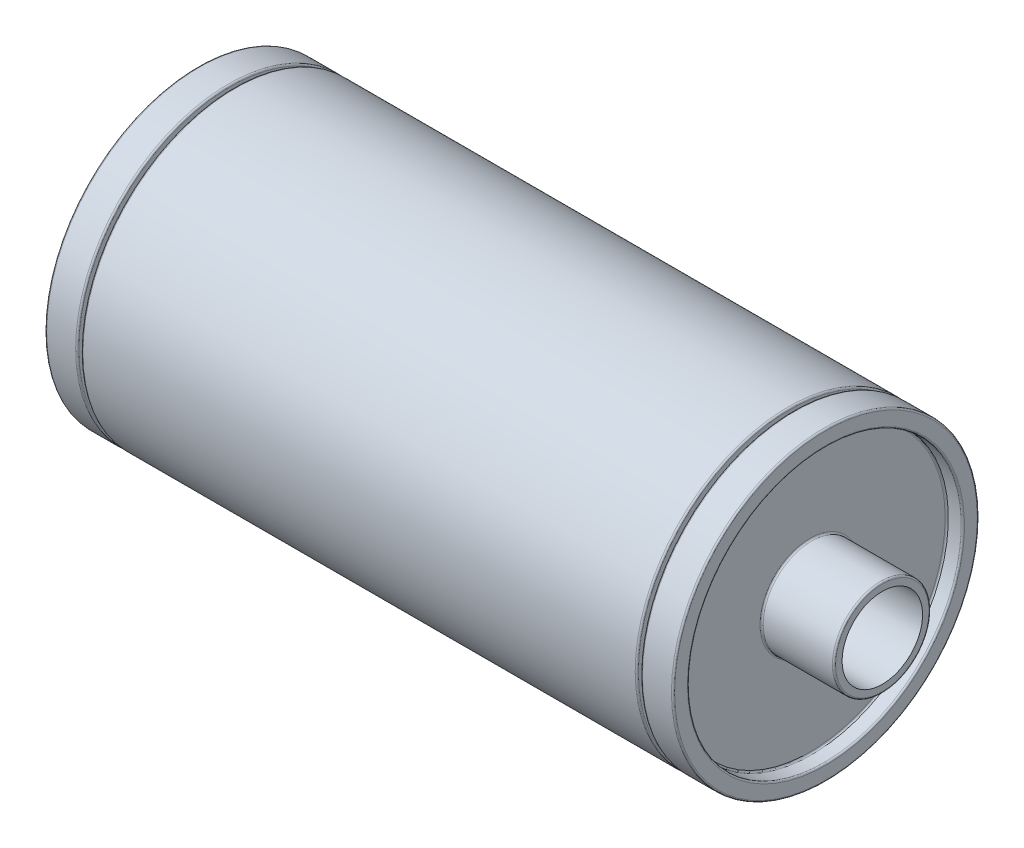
ISO-10303-21;
HEADER;
FILE_DESCRIPTION(('STEP AP214'),'2;1');
FILE_NAME('part.step','',(''),(''),'','','');
FILE_SCHEMA(('AUTOMOTIVE_DESIGN { 1 0 10303 214 1 1 1 1 }'));
ENDSEC;
DATA;
#1=APPLICATION_CONTEXT('core data for automotive mechanical design processes');
#2=APPLICATION_PROTOCOL_DEFINITION('international standard','automotive_design',2000,#1);
#3=PRODUCT_CONTEXT('',#1,'mechanical');
#4=PRODUCT('Part','Part','',(#3));
#5=PRODUCT_RELATED_PRODUCT_CATEGORY('part','',(#4));
#6=PRODUCT_DEFINITION_FORMATION('','',#4);
#7=PRODUCT_DEFINITION_CONTEXT('part definition',#1,'design');
#8=PRODUCT_DEFINITION('design','',#6,#7);
#9=PRODUCT_DEFINITION_SHAPE('','',#8);
#10=(LENGTH_UNIT() NAMED_UNIT(*) SI_UNIT(.MILLI.,.METRE.));
#11=(NAMED_UNIT(*) PLANE_ANGLE_UNIT() SI_UNIT($,.RADIAN.));
#12=(NAMED_UNIT(*) SI_UNIT($,.STERADIAN.) SOLID_ANGLE_UNIT());
#13=UNCERTAINTY_MEASURE_WITH_UNIT(LENGTH_MEASURE(1.E-05),#10,'distance_accuracy_value','');
#14=(GEOMETRIC_REPRESENTATION_CONTEXT(3) GLOBAL_UNCERTAINTY_ASSIGNED_CONTEXT((#13)) GLOBAL_UNIT_ASSIGNED_CONTEXT((#10,
#11,#12)) REPRESENTATION_CONTEXT('',''));
#15=CARTESIAN_POINT('',(0.,0.,0.));
#16=DIRECTION('',(0.,0.,1.));
#17=DIRECTION('',(1.,0.,0.));
#18=AXIS2_PLACEMENT_3D('',#15,#16,#17);
#19=CARTESIAN_POINT('',(-23.,2.5,0.));
#20=DIRECTION('',(1.,0.,0.));
#21=DIRECTION('',(0.,0.,-1.));
#22=AXIS2_PLACEMENT_3D('',#19,#20,#21);
#23=PLANE('',#22);
#24=CARTESIAN_POINT('',(-23.,0.,0.));
#25=DIRECTION('',(1.,0.,0.));
#26=DIRECTION('',(0.,0.,-1.));
#27=AXIS2_PLACEMENT_3D('',#24,#25,#26);
#28=CIRCLE('',#27,2.9);
#29=CARTESIAN_POINT('',(-23.,0.,-2.9));
#30=VERTEX_POINT('',#29);
#31=EDGE_CURVE('E97',#30,#30,#28,.F.);
#32=ORIENTED_EDGE('',*,*,#31,.T.);
#33=EDGE_LOOP('',(#32));
#34=FACE_BOUND('',#33,.T.);
#35=CARTESIAN_POINT('',(-23.,0.,0.));
#36=DIRECTION('',(-1.,0.,0.));
#37=DIRECTION('',(0.,0.,1.));
#38=AXIS2_PLACEMENT_3D('',#35,#36,#37);
#39=CIRCLE('',#38,2.5);
#40=CARTESIAN_POINT('',(-23.,0.,2.5));
#41=VERTEX_POINT('',#40);
#42=EDGE_CURVE('E136',#41,#41,#39,.T.);
#43=ORIENTED_EDGE('',*,*,#42,.F.);
#44=EDGE_LOOP('',(#43));
#45=FACE_BOUND('',#44,.T.);
#46=ADVANCED_FACE('F30',(#34,#45),#23,.F.);
#47=CARTESIAN_POINT('',(-72.4264344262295,0.,0.));
#48=DIRECTION('',(-1.,0.,0.));
#49=DIRECTION('',(0.,0.,1.));
#50=AXIS2_PLACEMENT_3D('',#47,#48,#49);
#51=CYLINDRICAL_SURFACE('',#50,3.);
#52=CARTESIAN_POINT('',(-22.9,0.,0.));
#53=DIRECTION('',(1.,0.,0.));
#54=DIRECTION('',(0.,0.,-1.));
#55=AXIS2_PLACEMENT_3D('',#52,#53,#54);
#56=CIRCLE('',#55,3.);
#57=CARTESIAN_POINT('',(-22.9,0.,-3.));
#58=VERTEX_POINT('',#57);
#59=EDGE_CURVE('E91',#58,#58,#56,.T.);
#60=ORIENTED_EDGE('',*,*,#59,.T.);
#61=EDGE_LOOP('',(#60));
#62=FACE_BOUND('',#61,.T.);
#63=CARTESIAN_POINT('',(-18.6,0.,0.));
#64=DIRECTION('',(1.,0.,0.));
#65=DIRECTION('',(0.,0.,-1.));
#66=AXIS2_PLACEMENT_3D('',#63,#64,#65);
#67=CIRCLE('',#66,3.);
#68=CARTESIAN_POINT('',(-18.6,0.,-3.));
#69=VERTEX_POINT('',#68);
#70=EDGE_CURVE('E94',#69,#69,#67,.F.);
#71=ORIENTED_EDGE('',*,*,#70,.T.);
#72=EDGE_LOOP('',(#71));
#73=FACE_BOUND('',#72,.T.);
#74=ADVANCED_FACE('F143',(#62,#73),#51,.T.);
#75=CARTESIAN_POINT('',(-18.5,3.,0.));
#76=DIRECTION('',(1.,0.,0.));
#77=DIRECTION('',(0.,0.,-1.));
#78=AXIS2_PLACEMENT_3D('',#75,#76,#77);
#79=PLANE('',#78);
#80=CARTESIAN_POINT('',(-18.5,0.,0.));
#81=DIRECTION('',(1.,0.,0.));
#82=DIRECTION('',(0.,0.,-1.));
#83=AXIS2_PLACEMENT_3D('',#80,#81,#82);
#84=CIRCLE('',#83,8.4);
#85=CARTESIAN_POINT('',(-18.5,0.,-8.4));
#86=VERTEX_POINT('',#85);
#87=EDGE_CURVE('E85',#86,#86,#84,.F.);
#88=ORIENTED_EDGE('',*,*,#87,.T.);
#89=EDGE_LOOP('',(#88));
#90=FACE_BOUND('',#89,.T.);
#91=CARTESIAN_POINT('',(-18.5,0.,0.));
#92=DIRECTION('',(1.,0.,0.));
#93=DIRECTION('',(0.,0.,-1.));
#94=AXIS2_PLACEMENT_3D('',#91,#92,#93);
#95=CIRCLE('',#94,3.1);
#96=CARTESIAN_POINT('',(-18.5,0.,-3.1));
#97=VERTEX_POINT('',#96);
#98=EDGE_CURVE('E88',#97,#97,#95,.T.);
#99=ORIENTED_EDGE('',*,*,#98,.T.);
#100=EDGE_LOOP('',(#99));
#101=FACE_BOUND('',#100,.T.);
#102=ADVANCED_FACE('F148',(#90,#101),#79,.F.);
#103=CARTESIAN_POINT('',(-72.4264344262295,0.,0.));
#104=DIRECTION('',(-1.,0.,0.));
#105=DIRECTION('',(0.,0.,1.));
#106=AXIS2_PLACEMENT_3D('',#103,#104,#105);
#107=CYLINDRICAL_SURFACE('',#106,8.5);
#108=CARTESIAN_POINT('',(-19.4,0.,0.));
#109=DIRECTION('',(1.,0.,0.));
#110=DIRECTION('',(0.,0.,-1.));
#111=AXIS2_PLACEMENT_3D('',#108,#109,#110);
#112=CIRCLE('',#111,8.5);
#113=CARTESIAN_POINT('',(-19.4,0.,-8.5));
#114=VERTEX_POINT('',#113);
#115=EDGE_CURVE('E100',#114,#114,#112,.F.);
#116=ORIENTED_EDGE('',*,*,#115,.T.);
#117=EDGE_LOOP('',(#116));
#118=FACE_BOUND('',#117,.T.);
#119=CARTESIAN_POINT('',(-18.6,0.,0.));
#120=DIRECTION('',(1.,0.,0.));
#121=DIRECTION('',(0.,0.,-1.));
#122=AXIS2_PLACEMENT_3D('',#119,#120,#121);
#123=CIRCLE('',#122,8.5);
#124=CARTESIAN_POINT('',(-18.6,0.,-8.5));
#125=VERTEX_POINT('',#124);
#126=EDGE_CURVE('E103',#125,#125,#123,.T.);
#127=ORIENTED_EDGE('',*,*,#126,.T.);
#128=EDGE_LOOP('',(#127));
#129=FACE_BOUND('',#128,.T.);
#130=ADVANCED_FACE('F238',(#118,#129),#107,.F.);
#131=CARTESIAN_POINT('',(-19.5,8.5,0.));
#132=DIRECTION('',(1.,0.,0.));
#133=DIRECTION('',(0.,0.,-1.));
#134=AXIS2_PLACEMENT_3D('',#131,#132,#133);
#135=PLANE('',#134);
#136=CARTESIAN_POINT('',(-19.5,0.,0.));
#137=DIRECTION('',(1.,0.,0.));
#138=DIRECTION('',(0.,0.,-1.));
#139=AXIS2_PLACEMENT_3D('',#136,#137,#138);
#140=CIRCLE('',#139,9.4);
#141=CARTESIAN_POINT('',(-19.5,0.,-9.4));
#142=VERTEX_POINT('',#141);
#143=EDGE_CURVE('E106',#142,#142,#140,.F.);
#144=ORIENTED_EDGE('',*,*,#143,.T.);
#145=EDGE_LOOP('',(#144));
#146=FACE_BOUND('',#145,.T.);
#147=CARTESIAN_POINT('',(-19.5,0.,0.));
#148=DIRECTION('',(1.,0.,0.));
#149=DIRECTION('',(0.,0.,-1.));
#150=AXIS2_PLACEMENT_3D('',#147,#148,#149);
#151=CIRCLE('',#150,8.6);
#152=CARTESIAN_POINT('',(-19.5,0.,-8.6));
#153=VERTEX_POINT('',#152);
#154=EDGE_CURVE('E109',#153,#153,#151,.T.);
#155=ORIENTED_EDGE('',*,*,#154,.T.);
#156=EDGE_LOOP('',(#155));
#157=FACE_BOUND('',#156,.T.);
#158=ADVANCED_FACE('F234',(#146,#157),#135,.F.);
#159=CARTESIAN_POINT('',(-72.4264344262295,0.,0.));
#160=DIRECTION('',(-1.,0.,0.));
#161=DIRECTION('',(0.,0.,1.));
#162=AXIS2_PLACEMENT_3D('',#159,#160,#161);
#163=CYLINDRICAL_SURFACE('',#162,9.5);
#164=CARTESIAN_POINT('',(-17.6,0.,0.));
#165=DIRECTION('',(-1.,0.,0.));
#166=DIRECTION('',(0.,0.,1.));
#167=AXIS2_PLACEMENT_3D('',#164,#165,#166);
#168=CIRCLE('',#167,9.5);
#169=CARTESIAN_POINT('',(-17.6,0.,9.5));
#170=VERTEX_POINT('',#169);
#171=EDGE_CURVE('E115',#170,#170,#168,.T.);
#172=ORIENTED_EDGE('',*,*,#171,.T.);
#173=EDGE_LOOP('',(#172));
#174=FACE_BOUND('',#173,.T.);
#175=CARTESIAN_POINT('',(-19.4,0.,0.));
#176=DIRECTION('',(1.,0.,0.));
#177=DIRECTION('',(0.,0.,-1.));
#178=AXIS2_PLACEMENT_3D('',#175,#176,#177);
#179=CIRCLE('',#178,9.5);
#180=CARTESIAN_POINT('',(-19.4,0.,-9.5));
#181=VERTEX_POINT('',#180);
#182=EDGE_CURVE('E118',#181,#181,#179,.T.);
#183=ORIENTED_EDGE('',*,*,#182,.T.);
#184=EDGE_LOOP('',(#183));
#185=FACE_BOUND('',#184,.T.);
#186=ADVANCED_FACE('F230',(#174,#185),#163,.T.);
#187=CARTESIAN_POINT('',(-17.5,9.5,0.));
#188=DIRECTION('',(-1.,0.,0.));
#189=DIRECTION('',(0.,0.,1.));
#190=AXIS2_PLACEMENT_3D('',#187,#188,#189);
#191=PLANE('',#190);
#192=CARTESIAN_POINT('',(-17.5,0.,0.));
#193=DIRECTION('',(-1.,0.,0.));
#194=DIRECTION('',(0.,0.,1.));
#195=AXIS2_PLACEMENT_3D('',#192,#193,#194);
#196=CIRCLE('',#195,9.4);
#197=CARTESIAN_POINT('',(-17.5,0.,9.4));
#198=VERTEX_POINT('',#197);
#199=EDGE_CURVE('E112',#198,#198,#196,.F.);
#200=ORIENTED_EDGE('',*,*,#199,.T.);
#201=EDGE_LOOP('',(#200));
#202=FACE_BOUND('',#201,.T.);
#203=CARTESIAN_POINT('',(-17.5,0.,0.));
#204=DIRECTION('',(-1.,0.,0.));
#205=DIRECTION('',(0.,0.,1.));
#206=AXIS2_PLACEMENT_3D('',#203,#204,#205);
#207=CIRCLE('',#206,9.);
#208=CARTESIAN_POINT('',(-17.5,0.,9.));
#209=VERTEX_POINT('',#208);
#210=EDGE_CURVE('E121',#209,#209,#207,.T.);
#211=ORIENTED_EDGE('',*,*,#210,.T.);
#212=EDGE_LOOP('',(#211));
#213=FACE_BOUND('',#212,.T.);
#214=ADVANCED_FACE('F226',(#202,#213),#191,.F.);
#215=CARTESIAN_POINT('',(-72.4264344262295,0.,0.));
#216=DIRECTION('',(-1.,0.,0.));
#217=DIRECTION('',(0.,0.,1.));
#218=AXIS2_PLACEMENT_3D('',#215,#216,#217);
#219=CYLINDRICAL_SURFACE('',#218,9.);
#220=ORIENTED_EDGE('',*,*,#210,.F.);
#221=EDGE_LOOP('',(#220));
#222=FACE_BOUND('',#221,.T.);
#223=CARTESIAN_POINT('',(-17.25,0.,0.));
#224=DIRECTION('',(-1.,0.,0.));
#225=DIRECTION('',(0.,0.,1.));
#226=AXIS2_PLACEMENT_3D('',#223,#224,#225);
#227=CIRCLE('',#226,9.);
#228=CARTESIAN_POINT('',(-17.25,0.,9.));
#229=VERTEX_POINT('',#228);
#230=EDGE_CURVE('E124',#229,#229,#227,.T.);
#231=ORIENTED_EDGE('',*,*,#230,.T.);
#232=EDGE_LOOP('',(#231));
#233=FACE_BOUND('',#232,.T.);
#234=ADVANCED_FACE('F223',(#222,#233),#219,.T.);
#235=CARTESIAN_POINT('',(-17.25,9.,0.));
#236=DIRECTION('',(1.,0.,0.));
#237=DIRECTION('',(0.,0.,-1.));
#238=AXIS2_PLACEMENT_3D('',#235,#236,#237);
#239=PLANE('',#238);
#240=CARTESIAN_POINT('',(-17.25,0.,0.));
#241=DIRECTION('',(1.,0.,0.));
#242=DIRECTION('',(0.,0.,-1.));
#243=AXIS2_PLACEMENT_3D('',#240,#241,#242);
#244=CIRCLE('',#243,9.4);
#245=CARTESIAN_POINT('',(-17.25,0.,-9.4));
#246=VERTEX_POINT('',#245);
#247=EDGE_CURVE('E10',#246,#246,#244,.F.);
#248=ORIENTED_EDGE('',*,*,#247,.T.);
#249=EDGE_LOOP('',(#248));
#250=FACE_BOUND('',#249,.T.);
#251=ORIENTED_EDGE('',*,*,#230,.F.);
#252=EDGE_LOOP('',(#251));
#253=FACE_BOUND('',#252,.T.);
#254=ADVANCED_FACE('F219',(#250,#253),#239,.F.);
#255=CARTESIAN_POINT('',(-72.4264344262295,0.,0.));
#256=DIRECTION('',(-1.,0.,0.));
#257=DIRECTION('',(0.,0.,1.));
#258=AXIS2_PLACEMENT_3D('',#255,#256,#257);
#259=CYLINDRICAL_SURFACE('',#258,9.5);
#260=CARTESIAN_POINT('',(17.15,0.,0.));
#261=DIRECTION('',(-1.,0.,0.));
#262=DIRECTION('',(0.,0.,1.));
#263=AXIS2_PLACEMENT_3D('',#260,#261,#262);
#264=CIRCLE('',#263,9.5);
#265=CARTESIAN_POINT('',(17.15,0.,9.5));
#266=VERTEX_POINT('',#265);
#267=EDGE_CURVE('E40',#266,#266,#264,.T.);
#268=ORIENTED_EDGE('',*,*,#267,.T.);
#269=EDGE_LOOP('',(#268));
#270=FACE_BOUND('',#269,.T.);
#271=CARTESIAN_POINT('',(-17.15,0.,0.));
#272=DIRECTION('',(1.,0.,0.));
#273=DIRECTION('',(0.,0.,-1.));
#274=AXIS2_PLACEMENT_3D('',#271,#272,#273);
#275=CIRCLE('',#274,9.5);
#276=CARTESIAN_POINT('',(-17.15,0.,-9.5));
#277=VERTEX_POINT('',#276);
#278=EDGE_CURVE('E44',#277,#277,#275,.T.);
#279=ORIENTED_EDGE('',*,*,#278,.T.);
#280=EDGE_LOOP('',(#279));
#281=FACE_BOUND('',#280,.T.);
#282=ADVANCED_FACE('F216',(#270,#281),#259,.T.);
#283=CARTESIAN_POINT('',(17.25,9.,0.));
#284=DIRECTION('',(-1.,0.,0.));
#285=DIRECTION('',(0.,0.,1.));
#286=AXIS2_PLACEMENT_3D('',#283,#284,#285);
#287=PLANE('',#286);
#288=CARTESIAN_POINT('',(17.25,0.,0.));
#289=DIRECTION('',(-1.,0.,0.));
#290=DIRECTION('',(0.,0.,1.));
#291=AXIS2_PLACEMENT_3D('',#288,#289,#290);
#292=CIRCLE('',#291,9.4);
#293=CARTESIAN_POINT('',(17.25,0.,9.4));
#294=VERTEX_POINT('',#293);
#295=EDGE_CURVE('E36',#294,#294,#292,.F.);
#296=ORIENTED_EDGE('',*,*,#295,.T.);
#297=EDGE_LOOP('',(#296));
#298=FACE_BOUND('',#297,.T.);
#299=CARTESIAN_POINT('',(17.25,0.,0.));
#300=DIRECTION('',(-1.,0.,0.));
#301=DIRECTION('',(0.,0.,1.));
#302=AXIS2_PLACEMENT_3D('',#299,#300,#301);
#303=CIRCLE('',#302,9.);
#304=CARTESIAN_POINT('',(17.25,0.,9.));
#305=VERTEX_POINT('',#304);
#306=EDGE_CURVE('E127',#305,#305,#303,.T.);
#307=ORIENTED_EDGE('',*,*,#306,.T.);
#308=EDGE_LOOP('',(#307));
#309=FACE_BOUND('',#308,.T.);
#310=ADVANCED_FACE('F212',(#298,#309),#287,.F.);
#311=CARTESIAN_POINT('',(-72.4264344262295,0.,0.));
#312=DIRECTION('',(-1.,0.,0.));
#313=DIRECTION('',(0.,0.,1.));
#314=AXIS2_PLACEMENT_3D('',#311,#312,#313);
#315=CYLINDRICAL_SURFACE('',#314,9.);
#316=ORIENTED_EDGE('',*,*,#306,.F.);
#317=EDGE_LOOP('',(#316));
#318=FACE_BOUND('',#317,.T.);
#319=CARTESIAN_POINT('',(17.5,0.,0.));
#320=DIRECTION('',(-1.,0.,0.));
#321=DIRECTION('',(0.,0.,1.));
#322=AXIS2_PLACEMENT_3D('',#319,#320,#321);
#323=CIRCLE('',#322,9.);
#324=CARTESIAN_POINT('',(17.5,0.,9.));
#325=VERTEX_POINT('',#324);
#326=EDGE_CURVE('E130',#325,#325,#323,.T.);
#327=ORIENTED_EDGE('',*,*,#326,.T.);
#328=EDGE_LOOP('',(#327));
#329=FACE_BOUND('',#328,.T.);
#330=ADVANCED_FACE('F208',(#318,#329),#315,.T.);
#331=CARTESIAN_POINT('',(17.5,9.5,0.));
#332=DIRECTION('',(1.,0.,0.));
#333=DIRECTION('',(0.,0.,-1.));
#334=AXIS2_PLACEMENT_3D('',#331,#332,#333);
#335=PLANE('',#334);
#336=CARTESIAN_POINT('',(17.5,0.,0.));
#337=DIRECTION('',(1.,0.,0.));
#338=DIRECTION('',(0.,0.,-1.));
#339=AXIS2_PLACEMENT_3D('',#336,#337,#338);
#340=CIRCLE('',#339,9.4);
#341=CARTESIAN_POINT('',(17.5,0.,-9.4));
#342=VERTEX_POINT('',#341);
#343=EDGE_CURVE('E64',#342,#342,#340,.F.);
#344=ORIENTED_EDGE('',*,*,#343,.T.);
#345=EDGE_LOOP('',(#344));
#346=FACE_BOUND('',#345,.T.);
#347=ORIENTED_EDGE('',*,*,#326,.F.);
#348=EDGE_LOOP('',(#347));
#349=FACE_BOUND('',#348,.T.);
#350=ADVANCED_FACE('F204',(#346,#349),#335,.F.);
#351=CARTESIAN_POINT('',(-72.4264344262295,0.,0.));
#352=DIRECTION('',(-1.,0.,0.));
#353=DIRECTION('',(0.,0.,1.));
#354=AXIS2_PLACEMENT_3D('',#351,#352,#353);
#355=CYLINDRICAL_SURFACE('',#354,9.5);
#356=CARTESIAN_POINT('',(19.4,0.,0.));
#357=DIRECTION('',(-1.,0.,0.));
#358=DIRECTION('',(0.,0.,1.));
#359=AXIS2_PLACEMENT_3D('',#356,#357,#358);
#360=CIRCLE('',#359,9.5);
#361=CARTESIAN_POINT('',(19.4,0.,9.5));
#362=VERTEX_POINT('',#361);
#363=EDGE_CURVE('E67',#362,#362,#360,.T.);
#364=ORIENTED_EDGE('',*,*,#363,.T.);
#365=EDGE_LOOP('',(#364));
#366=FACE_BOUND('',#365,.T.);
#367=CARTESIAN_POINT('',(17.6,0.,0.));
#368=DIRECTION('',(1.,0.,0.));
#369=DIRECTION('',(0.,0.,-1.));
#370=AXIS2_PLACEMENT_3D('',#367,#368,#369);
#371=CIRCLE('',#370,9.5);
#372=CARTESIAN_POINT('',(17.6,0.,-9.5));
#373=VERTEX_POINT('',#372);
#374=EDGE_CURVE('E70',#373,#373,#371,.T.);
#375=ORIENTED_EDGE('',*,*,#374,.T.);
#376=EDGE_LOOP('',(#375));
#377=FACE_BOUND('',#376,.T.);
#378=ADVANCED_FACE('F200',(#366,#377),#355,.T.);
#379=CARTESIAN_POINT('',(19.5,8.5,0.));
#380=DIRECTION('',(-1.,0.,0.));
#381=DIRECTION('',(0.,0.,1.));
#382=AXIS2_PLACEMENT_3D('',#379,#380,#381);
#383=PLANE('',#382);
#384=CARTESIAN_POINT('',(19.5,0.,0.));
#385=DIRECTION('',(-1.,0.,0.));
#386=DIRECTION('',(0.,0.,1.));
#387=AXIS2_PLACEMENT_3D('',#384,#385,#386);
#388=CIRCLE('',#387,8.6);
#389=CARTESIAN_POINT('',(19.5,0.,8.6));
#390=VERTEX_POINT('',#389);
#391=EDGE_CURVE('E79',#390,#390,#388,.T.);
#392=ORIENTED_EDGE('',*,*,#391,.T.);
#393=EDGE_LOOP('',(#392));
#394=FACE_BOUND('',#393,.T.);
#395=CARTESIAN_POINT('',(19.5,0.,0.));
#396=DIRECTION('',(-1.,0.,0.));
#397=DIRECTION('',(0.,0.,1.));
#398=AXIS2_PLACEMENT_3D('',#395,#396,#397);
#399=CIRCLE('',#398,9.4);
#400=CARTESIAN_POINT('',(19.5,0.,9.4));
#401=VERTEX_POINT('',#400);
#402=EDGE_CURVE('E82',#401,#401,#399,.F.);
#403=ORIENTED_EDGE('',*,*,#402,.T.);
#404=EDGE_LOOP('',(#403));
#405=FACE_BOUND('',#404,.T.);
#406=ADVANCED_FACE('F196',(#394,#405),#383,.F.);
#407=CARTESIAN_POINT('',(-72.4264344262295,0.,0.));
#408=DIRECTION('',(-1.,0.,0.));
#409=DIRECTION('',(0.,0.,1.));
#410=AXIS2_PLACEMENT_3D('',#407,#408,#409);
#411=CYLINDRICAL_SURFACE('',#410,8.5);
#412=CARTESIAN_POINT('',(19.4,0.,0.));
#413=DIRECTION('',(-1.,0.,0.));
#414=DIRECTION('',(0.,0.,1.));
#415=AXIS2_PLACEMENT_3D('',#412,#413,#414);
#416=CIRCLE('',#415,8.5);
#417=CARTESIAN_POINT('',(19.4,0.,8.5));
#418=VERTEX_POINT('',#417);
#419=EDGE_CURVE('E73',#418,#418,#416,.F.);
#420=ORIENTED_EDGE('',*,*,#419,.T.);
#421=EDGE_LOOP('',(#420));
#422=FACE_BOUND('',#421,.T.);
#423=CARTESIAN_POINT('',(18.6,0.,0.));
#424=DIRECTION('',(-1.,0.,0.));
#425=DIRECTION('',(0.,0.,1.));
#426=AXIS2_PLACEMENT_3D('',#423,#424,#425);
#427=CIRCLE('',#426,8.5);
#428=CARTESIAN_POINT('',(18.6,0.,8.5));
#429=VERTEX_POINT('',#428);
#430=EDGE_CURVE('E76',#429,#429,#427,.T.);
#431=ORIENTED_EDGE('',*,*,#430,.T.);
#432=EDGE_LOOP('',(#431));
#433=FACE_BOUND('',#432,.T.);
#434=ADVANCED_FACE('F192',(#422,#433),#411,.F.);
#435=CARTESIAN_POINT('',(18.5,3.,0.));
#436=DIRECTION('',(-1.,0.,0.));
#437=DIRECTION('',(0.,0.,1.));
#438=AXIS2_PLACEMENT_3D('',#435,#436,#437);
#439=PLANE('',#438);
#440=CARTESIAN_POINT('',(18.5,0.,0.));
#441=DIRECTION('',(-1.,0.,0.));
#442=DIRECTION('',(0.,0.,1.));
#443=AXIS2_PLACEMENT_3D('',#440,#441,#442);
#444=CIRCLE('',#443,8.4);
#445=CARTESIAN_POINT('',(18.5,0.,8.4));
#446=VERTEX_POINT('',#445);
#447=EDGE_CURVE('E58',#446,#446,#444,.F.);
#448=ORIENTED_EDGE('',*,*,#447,.T.);
#449=EDGE_LOOP('',(#448));
#450=FACE_BOUND('',#449,.T.);
#451=CARTESIAN_POINT('',(18.5,0.,0.));
#452=DIRECTION('',(-1.,0.,0.));
#453=DIRECTION('',(0.,0.,1.));
#454=AXIS2_PLACEMENT_3D('',#451,#452,#453);
#455=CIRCLE('',#454,3.1);
#456=CARTESIAN_POINT('',(18.5,0.,3.1));
#457=VERTEX_POINT('',#456);
#458=EDGE_CURVE('E61',#457,#457,#455,.T.);
#459=ORIENTED_EDGE('',*,*,#458,.T.);
#460=EDGE_LOOP('',(#459));
#461=FACE_BOUND('',#460,.T.);
#462=ADVANCED_FACE('F188',(#450,#461),#439,.F.);
#463=CARTESIAN_POINT('',(-72.4264344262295,0.,0.));
#464=DIRECTION('',(-1.,0.,0.));
#465=DIRECTION('',(0.,0.,1.));
#466=AXIS2_PLACEMENT_3D('',#463,#464,#465);
#467=CYLINDRICAL_SURFACE('',#466,3.);
#468=CARTESIAN_POINT('',(22.9,0.,0.));
#469=DIRECTION('',(-1.,0.,0.));
#470=DIRECTION('',(0.,0.,1.));
#471=AXIS2_PLACEMENT_3D('',#468,#469,#470);
#472=CIRCLE('',#471,3.);
#473=CARTESIAN_POINT('',(22.9,0.,3.));
#474=VERTEX_POINT('',#473);
#475=EDGE_CURVE('E52',#474,#474,#472,.T.);
#476=ORIENTED_EDGE('',*,*,#475,.T.);
#477=EDGE_LOOP('',(#476));
#478=FACE_BOUND('',#477,.T.);
#479=CARTESIAN_POINT('',(18.6,0.,0.));
#480=DIRECTION('',(-1.,0.,0.));
#481=DIRECTION('',(0.,0.,1.));
#482=AXIS2_PLACEMENT_3D('',#479,#480,#481);
#483=CIRCLE('',#482,3.);
#484=CARTESIAN_POINT('',(18.6,0.,3.));
#485=VERTEX_POINT('',#484);
#486=EDGE_CURVE('E55',#485,#485,#483,.F.);
#487=ORIENTED_EDGE('',*,*,#486,.T.);
#488=EDGE_LOOP('',(#487));
#489=FACE_BOUND('',#488,.T.);
#490=ADVANCED_FACE('F184',(#478,#489),#467,.T.);
#491=CARTESIAN_POINT('',(23.,2.5,0.));
#492=DIRECTION('',(-1.,0.,0.));
#493=DIRECTION('',(0.,0.,1.));
#494=AXIS2_PLACEMENT_3D('',#491,#492,#493);
#495=PLANE('',#494);
#496=CARTESIAN_POINT('',(23.,0.,0.));
#497=DIRECTION('',(-1.,0.,0.));
#498=DIRECTION('',(0.,0.,1.));
#499=AXIS2_PLACEMENT_3D('',#496,#497,#498);
#500=CIRCLE('',#499,2.9);
#501=CARTESIAN_POINT('',(23.,0.,2.9));
#502=VERTEX_POINT('',#501);
#503=EDGE_CURVE('E49',#502,#502,#500,.F.);
#504=ORIENTED_EDGE('',*,*,#503,.T.);
#505=EDGE_LOOP('',(#504));
#506=FACE_BOUND('',#505,.T.);
#507=CARTESIAN_POINT('',(23.,0.,0.));
#508=DIRECTION('',(-1.,0.,0.));
#509=DIRECTION('',(0.,0.,1.));
#510=AXIS2_PLACEMENT_3D('',#507,#508,#509);
#511=CIRCLE('',#510,2.5);
#512=CARTESIAN_POINT('',(23.,0.,2.5));
#513=VERTEX_POINT('',#512);
#514=EDGE_CURVE('E133',#513,#513,#511,.T.);
#515=ORIENTED_EDGE('',*,*,#514,.T.);
#516=EDGE_LOOP('',(#515));
#517=FACE_BOUND('',#516,.T.);
#518=ADVANCED_FACE('F180',(#506,#517),#495,.F.);
#519=CARTESIAN_POINT('',(-72.4264344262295,0.,0.));
#520=DIRECTION('',(-1.,0.,0.));
#521=DIRECTION('',(0.,0.,1.));
#522=AXIS2_PLACEMENT_3D('',#519,#520,#521);
#523=CYLINDRICAL_SURFACE('',#522,2.5);
#524=ORIENTED_EDGE('',*,*,#514,.F.);
#525=EDGE_LOOP('',(#524));
#526=FACE_BOUND('',#525,.T.);
#527=ORIENTED_EDGE('',*,*,#42,.T.);
#528=EDGE_LOOP('',(#527));
#529=FACE_BOUND('',#528,.T.);
#530=ADVANCED_FACE('F140',(#526,#529),#523,.F.);
#531=CARTESIAN_POINT('',(-17.6,0.,0.));
#532=DIRECTION('',(-1.,0.,0.));
#533=DIRECTION('',(0.,0.,1.));
#534=AXIS2_PLACEMENT_3D('',#531,#532,#533);
#535=TOROIDAL_SURFACE('',#534,9.4,0.1);
#536=ORIENTED_EDGE('',*,*,#199,.F.);
#537=EDGE_LOOP('',(#536));
#538=FACE_BOUND('',#537,.T.);
#539=ORIENTED_EDGE('',*,*,#171,.F.);
#540=EDGE_LOOP('',(#539));
#541=FACE_BOUND('',#540,.T.);
#542=ADVANCED_FACE('F173',(#538,#541),#535,.T.);
#543=CARTESIAN_POINT('',(-19.4,0.,0.));
#544=DIRECTION('',(1.,0.,0.));
#545=DIRECTION('',(0.,0.,-1.));
#546=AXIS2_PLACEMENT_3D('',#543,#544,#545);
#547=TOROIDAL_SURFACE('',#546,9.4,0.1);
#548=ORIENTED_EDGE('',*,*,#182,.F.);
#549=EDGE_LOOP('',(#548));
#550=FACE_BOUND('',#549,.T.);
#551=ORIENTED_EDGE('',*,*,#143,.F.);
#552=EDGE_LOOP('',(#551));
#553=FACE_BOUND('',#552,.T.);
#554=ADVANCED_FACE('F165',(#550,#553),#547,.T.);
#555=CARTESIAN_POINT('',(-19.4,0.,0.));
#556=DIRECTION('',(1.,0.,0.));
#557=DIRECTION('',(0.,0.,-1.));
#558=AXIS2_PLACEMENT_3D('',#555,#556,#557);
#559=TOROIDAL_SURFACE('',#558,8.6,0.1);
#560=ORIENTED_EDGE('',*,*,#154,.F.);
#561=EDGE_LOOP('',(#560));
#562=FACE_BOUND('',#561,.T.);
#563=ORIENTED_EDGE('',*,*,#115,.F.);
#564=EDGE_LOOP('',(#563));
#565=FACE_BOUND('',#564,.T.);
#566=ADVANCED_FACE('F155',(#562,#565),#559,.T.);
#567=CARTESIAN_POINT('',(-22.9,0.,0.));
#568=DIRECTION('',(1.,0.,0.));
#569=DIRECTION('',(0.,0.,-1.));
#570=AXIS2_PLACEMENT_3D('',#567,#568,#569);
#571=TOROIDAL_SURFACE('',#570,2.9,0.1);
#572=ORIENTED_EDGE('',*,*,#59,.F.);
#573=EDGE_LOOP('',(#572));
#574=FACE_BOUND('',#573,.T.);
#575=ORIENTED_EDGE('',*,*,#31,.F.);
#576=EDGE_LOOP('',(#575));
#577=FACE_BOUND('',#576,.T.);
#578=ADVANCED_FACE('F152',(#574,#577),#571,.T.);
#579=CARTESIAN_POINT('',(-18.6,0.,0.));
#580=DIRECTION('',(1.,0.,0.));
#581=DIRECTION('',(0.,0.,-1.));
#582=AXIS2_PLACEMENT_3D('',#579,#580,#581);
#583=TOROIDAL_SURFACE('',#582,8.4,0.1);
#584=ORIENTED_EDGE('',*,*,#126,.F.);
#585=EDGE_LOOP('',(#584));
#586=FACE_BOUND('',#585,.T.);
#587=ORIENTED_EDGE('',*,*,#87,.F.);
#588=EDGE_LOOP('',(#587));
#589=FACE_BOUND('',#588,.T.);
#590=ADVANCED_FACE('F154',(#586,#589),#583,.F.);
#591=CARTESIAN_POINT('',(-18.6,0.,0.));
#592=DIRECTION('',(1.,0.,0.));
#593=DIRECTION('',(0.,0.,-1.));
#594=AXIS2_PLACEMENT_3D('',#591,#592,#593);
#595=TOROIDAL_SURFACE('',#594,3.1,0.1);
#596=ORIENTED_EDGE('',*,*,#98,.F.);
#597=EDGE_LOOP('',(#596));
#598=FACE_BOUND('',#597,.T.);
#599=ORIENTED_EDGE('',*,*,#70,.F.);
#600=EDGE_LOOP('',(#599));
#601=FACE_BOUND('',#600,.T.);
#602=ADVANCED_FACE('F162',(#598,#601),#595,.F.);
#603=CARTESIAN_POINT('',(19.4,0.,0.));
#604=DIRECTION('',(-1.,0.,0.));
#605=DIRECTION('',(0.,0.,1.));
#606=AXIS2_PLACEMENT_3D('',#603,#604,#605);
#607=TOROIDAL_SURFACE('',#606,8.6,0.1);
#608=ORIENTED_EDGE('',*,*,#419,.F.);
#609=EDGE_LOOP('',(#608));
#610=FACE_BOUND('',#609,.T.);
#611=ORIENTED_EDGE('',*,*,#391,.F.);
#612=EDGE_LOOP('',(#611));
#613=FACE_BOUND('',#612,.T.);
#614=ADVANCED_FACE('F253',(#610,#613),#607,.T.);
#615=CARTESIAN_POINT('',(19.4,0.,0.));
#616=DIRECTION('',(-1.,0.,0.));
#617=DIRECTION('',(0.,0.,1.));
#618=AXIS2_PLACEMENT_3D('',#615,#616,#617);
#619=TOROIDAL_SURFACE('',#618,9.4,0.1);
#620=ORIENTED_EDGE('',*,*,#402,.F.);
#621=EDGE_LOOP('',(#620));
#622=FACE_BOUND('',#621,.T.);
#623=ORIENTED_EDGE('',*,*,#363,.F.);
#624=EDGE_LOOP('',(#623));
#625=FACE_BOUND('',#624,.T.);
#626=ADVANCED_FACE('F259',(#622,#625),#619,.T.);
#627=CARTESIAN_POINT('',(17.6,0.,0.));
#628=DIRECTION('',(1.,0.,0.));
#629=DIRECTION('',(0.,0.,-1.));
#630=AXIS2_PLACEMENT_3D('',#627,#628,#629);
#631=TOROIDAL_SURFACE('',#630,9.4,0.1);
#632=ORIENTED_EDGE('',*,*,#374,.F.);
#633=EDGE_LOOP('',(#632));
#634=FACE_BOUND('',#633,.T.);
#635=ORIENTED_EDGE('',*,*,#343,.F.);
#636=EDGE_LOOP('',(#635));
#637=FACE_BOUND('',#636,.T.);
#638=ADVANCED_FACE('F265',(#634,#637),#631,.T.);
#639=CARTESIAN_POINT('',(18.6,0.,0.));
#640=DIRECTION('',(-1.,0.,0.));
#641=DIRECTION('',(0.,0.,1.));
#642=AXIS2_PLACEMENT_3D('',#639,#640,#641);
#643=TOROIDAL_SURFACE('',#642,8.4,0.1);
#644=ORIENTED_EDGE('',*,*,#447,.F.);
#645=EDGE_LOOP('',(#644));
#646=FACE_BOUND('',#645,.T.);
#647=ORIENTED_EDGE('',*,*,#430,.F.);
#648=EDGE_LOOP('',(#647));
#649=FACE_BOUND('',#648,.T.);
#650=ADVANCED_FACE('F269',(#646,#649),#643,.F.);
#651=CARTESIAN_POINT('',(22.9,0.,0.));
#652=DIRECTION('',(-1.,0.,0.));
#653=DIRECTION('',(0.,0.,1.));
#654=AXIS2_PLACEMENT_3D('',#651,#652,#653);
#655=TOROIDAL_SURFACE('',#654,2.9,0.1);
#656=ORIENTED_EDGE('',*,*,#503,.F.);
#657=EDGE_LOOP('',(#656));
#658=FACE_BOUND('',#657,.T.);
#659=ORIENTED_EDGE('',*,*,#475,.F.);
#660=EDGE_LOOP('',(#659));
#661=FACE_BOUND('',#660,.T.);
#662=ADVANCED_FACE('F273',(#658,#661),#655,.T.);
#663=CARTESIAN_POINT('',(18.6,0.,0.));
#664=DIRECTION('',(-1.,0.,0.));
#665=DIRECTION('',(0.,0.,1.));
#666=AXIS2_PLACEMENT_3D('',#663,#664,#665);
#667=TOROIDAL_SURFACE('',#666,3.1,0.1);
#668=ORIENTED_EDGE('',*,*,#486,.F.);
#669=EDGE_LOOP('',(#668));
#670=FACE_BOUND('',#669,.T.);
#671=ORIENTED_EDGE('',*,*,#458,.F.);
#672=EDGE_LOOP('',(#671));
#673=FACE_BOUND('',#672,.T.);
#674=ADVANCED_FACE('F277',(#670,#673),#667,.F.);
#675=CARTESIAN_POINT('',(17.15,0.,0.));
#676=DIRECTION('',(-1.,0.,0.));
#677=DIRECTION('',(0.,0.,1.));
#678=AXIS2_PLACEMENT_3D('',#675,#676,#677);
#679=TOROIDAL_SURFACE('',#678,9.4,0.1);
#680=ORIENTED_EDGE('',*,*,#295,.F.);
#681=EDGE_LOOP('',(#680));
#682=FACE_BOUND('',#681,.T.);
#683=ORIENTED_EDGE('',*,*,#267,.F.);
#684=EDGE_LOOP('',(#683));
#685=FACE_BOUND('',#684,.T.);
#686=ADVANCED_FACE('F281',(#682,#685),#679,.T.);
#687=CARTESIAN_POINT('',(-17.15,0.,0.));
#688=DIRECTION('',(1.,0.,0.));
#689=DIRECTION('',(0.,0.,-1.));
#690=AXIS2_PLACEMENT_3D('',#687,#688,#689);
#691=TOROIDAL_SURFACE('',#690,9.4,0.1);
#692=ORIENTED_EDGE('',*,*,#278,.F.);
#693=EDGE_LOOP('',(#692));
#694=FACE_BOUND('',#693,.T.);
#695=ORIENTED_EDGE('',*,*,#247,.F.);
#696=EDGE_LOOP('',(#695));
#697=FACE_BOUND('',#696,.T.);
#698=ADVANCED_FACE('F285',(#694,#697),#691,.T.);
#699=CLOSED_SHELL('',(#46,#74,#102,#130,#158,#186,#214,#234,#254,#282,#310,#330,#350,#378,#406,
#434,#462,#490,#518,#530,#542,#554,#566,#578,#590,#602,#614,#626,#638,#650,#662,#674,#686,#698));
#700=MANIFOLD_SOLID_BREP('B2',#699);
#701=ADVANCED_BREP_SHAPE_REPRESENTATION('',(#18,#700),#14);
#702=SHAPE_DEFINITION_REPRESENTATION(#9,#701);
ENDSEC;
END-ISO-10303-21;
